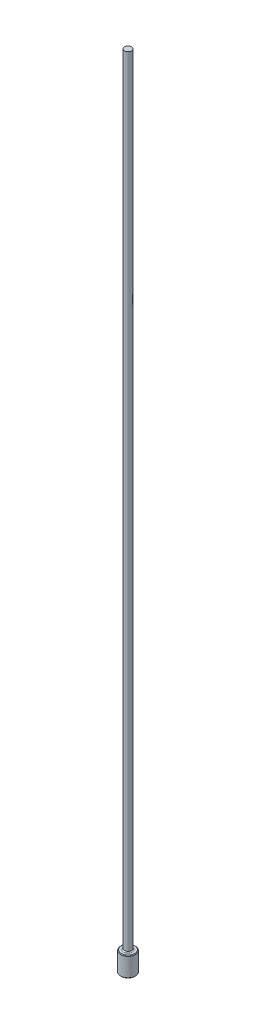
ISO-10303-21;
HEADER;
FILE_DESCRIPTION(('STEP AP214'),'2;1');
FILE_NAME('part.step','',(''),(''),'','','');
FILE_SCHEMA(('AUTOMOTIVE_DESIGN { 1 0 10303 214 1 1 1 1 }'));
ENDSEC;
DATA;
#1=APPLICATION_CONTEXT('core data for automotive mechanical design processes');
#2=APPLICATION_PROTOCOL_DEFINITION('international standard','automotive_design',2000,#1);
#3=PRODUCT_CONTEXT('',#1,'mechanical');
#4=PRODUCT('Part','Part','',(#3));
#5=PRODUCT_RELATED_PRODUCT_CATEGORY('part','',(#4));
#6=PRODUCT_DEFINITION_FORMATION('','',#4);
#7=PRODUCT_DEFINITION_CONTEXT('part definition',#1,'design');
#8=PRODUCT_DEFINITION('design','',#6,#7);
#9=PRODUCT_DEFINITION_SHAPE('','',#8);
#10=(LENGTH_UNIT() NAMED_UNIT(*) SI_UNIT(.MILLI.,.METRE.));
#11=(NAMED_UNIT(*) PLANE_ANGLE_UNIT() SI_UNIT($,.RADIAN.));
#12=(NAMED_UNIT(*) SI_UNIT($,.STERADIAN.) SOLID_ANGLE_UNIT());
#13=UNCERTAINTY_MEASURE_WITH_UNIT(LENGTH_MEASURE(1.E-05),#10,'distance_accuracy_value','');
#14=(GEOMETRIC_REPRESENTATION_CONTEXT(3) GLOBAL_UNCERTAINTY_ASSIGNED_CONTEXT((#13)) GLOBAL_UNIT_ASSIGNED_CONTEXT((#10,
#11,#12)) REPRESENTATION_CONTEXT('',''));
#15=CARTESIAN_POINT('',(0.,0.,0.));
#16=DIRECTION('',(0.,0.,1.));
#17=DIRECTION('',(1.,0.,0.));
#18=AXIS2_PLACEMENT_3D('',#15,#16,#17);
#19=CARTESIAN_POINT('',(0.,0.,0.));
#20=DIRECTION('',(0.,-1.,0.));
#21=DIRECTION('',(0.,0.,-1.));
#22=AXIS2_PLACEMENT_3D('',#19,#20,#21);
#23=PLANE('',#22);
#24=CARTESIAN_POINT('',(0.,0.,0.));
#25=DIRECTION('',(0.,-1.,0.));
#26=DIRECTION('',(0.,0.,-1.));
#27=AXIS2_PLACEMENT_3D('',#24,#25,#26);
#28=CIRCLE('',#27,0.533399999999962);
#29=CARTESIAN_POINT('',(0.,0.,-0.533399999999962));
#30=VERTEX_POINT('',#29);
#31=EDGE_CURVE('E46',#30,#30,#28,.T.);
#32=ORIENTED_EDGE('',*,*,#31,.T.);
#33=EDGE_LOOP('',(#32));
#34=FACE_BOUND('',#33,.T.);
#35=ADVANCED_FACE('F35',(#34),#23,.T.);
#36=CARTESIAN_POINT('',(0.,259.958771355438,0.));
#37=DIRECTION('',(0.,1.,0.));
#38=DIRECTION('',(0.,0.,1.));
#39=AXIS2_PLACEMENT_3D('',#36,#37,#38);
#40=CYLINDRICAL_SURFACE('',#39,0.584199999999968);
#41=CARTESIAN_POINT('',(0.,1.52399999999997,0.));
#42=DIRECTION('',(0.,1.,0.));
#43=DIRECTION('',(0.,0.,1.));
#44=AXIS2_PLACEMENT_3D('',#41,#42,#43);
#45=CIRCLE('',#44,0.584199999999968);
#46=CARTESIAN_POINT('',(0.,1.52399999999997,0.584199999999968));
#47=VERTEX_POINT('',#46);
#48=EDGE_CURVE('E50',#47,#47,#45,.F.);
#49=ORIENTED_EDGE('',*,*,#48,.T.);
#50=EDGE_LOOP('',(#49));
#51=FACE_BOUND('',#50,.T.);
#52=CARTESIAN_POINT('',(0.,0.0508000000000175,0.));
#53=DIRECTION('',(0.,-1.,0.));
#54=DIRECTION('',(0.,0.,-1.));
#55=AXIS2_PLACEMENT_3D('',#52,#53,#54);
#56=CIRCLE('',#55,0.584199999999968);
#57=CARTESIAN_POINT('',(0.,0.0508000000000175,-0.584199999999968));
#58=VERTEX_POINT('',#57);
#59=EDGE_CURVE('E55',#58,#58,#56,.F.);
#60=ORIENTED_EDGE('',*,*,#59,.T.);
#61=EDGE_LOOP('',(#60));
#62=FACE_BOUND('',#61,.T.);
#63=ADVANCED_FACE('F77',(#51,#62),#40,.T.);
#64=CARTESIAN_POINT('',(-0.584199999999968,1.5748,0.));
#65=DIRECTION('',(0.,1.,0.));
#66=DIRECTION('',(0.,0.,1.));
#67=AXIS2_PLACEMENT_3D('',#64,#65,#66);
#68=PLANE('',#67);
#69=CARTESIAN_POINT('',(0.,1.5748,0.));
#70=DIRECTION('',(0.,1.,0.));
#71=DIRECTION('',(0.,0.,1.));
#72=AXIS2_PLACEMENT_3D('',#69,#70,#71);
#73=CIRCLE('',#72,0.355599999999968);
#74=CARTESIAN_POINT('',(0.,1.5748,0.355599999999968));
#75=VERTEX_POINT('',#74);
#76=EDGE_CURVE('E10',#75,#75,#73,.F.);
#77=ORIENTED_EDGE('',*,*,#76,.T.);
#78=EDGE_LOOP('',(#77));
#79=FACE_BOUND('',#78,.T.);
#80=CARTESIAN_POINT('',(0.,1.5748,0.));
#81=DIRECTION('',(0.,1.,0.));
#82=DIRECTION('',(0.,0.,1.));
#83=AXIS2_PLACEMENT_3D('',#80,#81,#82);
#84=CIRCLE('',#83,0.533399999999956);
#85=CARTESIAN_POINT('',(0.,1.5748,0.533399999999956));
#86=VERTEX_POINT('',#85);
#87=EDGE_CURVE('E58',#86,#86,#84,.T.);
#88=ORIENTED_EDGE('',*,*,#87,.T.);
#89=EDGE_LOOP('',(#88));
#90=FACE_BOUND('',#89,.T.);
#91=ADVANCED_FACE('F69',(#79,#90),#68,.T.);
#92=CARTESIAN_POINT('',(0.,259.958771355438,0.));
#93=DIRECTION('',(0.,1.,0.));
#94=DIRECTION('',(0.,0.,1.));
#95=AXIS2_PLACEMENT_3D('',#92,#93,#94);
#96=CYLINDRICAL_SURFACE('',#95,0.279399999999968);
#97=CARTESIAN_POINT('',(0.,1.65100000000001,0.));
#98=DIRECTION('',(0.,1.,0.));
#99=DIRECTION('',(0.,0.,1.));
#100=AXIS2_PLACEMENT_3D('',#97,#98,#99);
#101=CIRCLE('',#100,0.279399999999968);
#102=CARTESIAN_POINT('',(0.,1.65100000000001,0.279399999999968));
#103=VERTEX_POINT('',#102);
#104=EDGE_CURVE('E42',#103,#103,#101,.T.);
#105=ORIENTED_EDGE('',*,*,#104,.T.);
#106=EDGE_LOOP('',(#105));
#107=FACE_BOUND('',#106,.T.);
#108=CARTESIAN_POINT('',(0.,63.5,0.));
#109=DIRECTION('',(0.,1.,0.));
#110=DIRECTION('',(0.,0.,1.));
#111=AXIS2_PLACEMENT_3D('',#108,#109,#110);
#112=CIRCLE('',#111,0.279399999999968);
#113=CARTESIAN_POINT('',(0.,63.5,0.279399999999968));
#114=VERTEX_POINT('',#113);
#115=EDGE_CURVE('E61',#114,#114,#112,.T.);
#116=ORIENTED_EDGE('',*,*,#115,.F.);
#117=EDGE_LOOP('',(#116));
#118=FACE_BOUND('',#117,.T.);
#119=ADVANCED_FACE('F67',(#107,#118),#96,.T.);
#120=CARTESIAN_POINT('',(-0.279399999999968,63.5,0.));
#121=DIRECTION('',(0.,1.,0.));
#122=DIRECTION('',(0.,0.,1.));
#123=AXIS2_PLACEMENT_3D('',#120,#121,#122);
#124=PLANE('',#123);
#125=ORIENTED_EDGE('',*,*,#115,.T.);
#126=EDGE_LOOP('',(#125));
#127=FACE_BOUND('',#126,.T.);
#128=ADVANCED_FACE('F65',(#127),#124,.T.);
#129=CARTESIAN_POINT('',(0.,1.57479999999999,0.));
#130=DIRECTION('',(0.,-1.,0.));
#131=DIRECTION('',(0.,0.,-1.));
#132=AXIS2_PLACEMENT_3D('',#129,#130,#131);
#133=CONICAL_SURFACE('',#132,0.533399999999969,0.785398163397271);
#134=ORIENTED_EDGE('',*,*,#48,.F.);
#135=EDGE_LOOP('',(#134));
#136=FACE_BOUND('',#135,.T.);
#137=ORIENTED_EDGE('',*,*,#87,.F.);
#138=EDGE_LOOP('',(#137));
#139=FACE_BOUND('',#138,.T.);
#140=ADVANCED_FACE('F75',(#136,#139),#133,.T.);
#141=CARTESIAN_POINT('',(0.,0.0508000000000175,0.));
#142=DIRECTION('',(0.,1.,0.));
#143=DIRECTION('',(0.,0.,1.));
#144=AXIS2_PLACEMENT_3D('',#141,#142,#143);
#145=CONICAL_SURFACE('',#144,0.584199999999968,0.785398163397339);
#146=ORIENTED_EDGE('',*,*,#31,.F.);
#147=EDGE_LOOP('',(#146));
#148=FACE_BOUND('',#147,.T.);
#149=ORIENTED_EDGE('',*,*,#59,.F.);
#150=EDGE_LOOP('',(#149));
#151=FACE_BOUND('',#150,.T.);
#152=ADVANCED_FACE('F89',(#148,#151),#145,.T.);
#153=CARTESIAN_POINT('',(0.,1.65100000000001,0.));
#154=DIRECTION('',(0.,1.,0.));
#155=DIRECTION('',(0.,0.,1.));
#156=AXIS2_PLACEMENT_3D('',#153,#154,#155);
#157=TOROIDAL_SURFACE('',#156,0.355599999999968,0.0762);
#158=ORIENTED_EDGE('',*,*,#76,.F.);
#159=EDGE_LOOP('',(#158));
#160=FACE_BOUND('',#159,.T.);
#161=ORIENTED_EDGE('',*,*,#104,.F.);
#162=EDGE_LOOP('',(#161));
#163=FACE_BOUND('',#162,.T.);
#164=ADVANCED_FACE('F37',(#160,#163),#157,.F.);
#165=CLOSED_SHELL('',(#35,#63,#91,#119,#128,#140,#152,#164));
#166=MANIFOLD_SOLID_BREP('B2',#165);
#167=ADVANCED_BREP_SHAPE_REPRESENTATION('',(#18,#166),#14);
#168=SHAPE_DEFINITION_REPRESENTATION(#9,#167);
ENDSEC;
END-ISO-10303-21;
